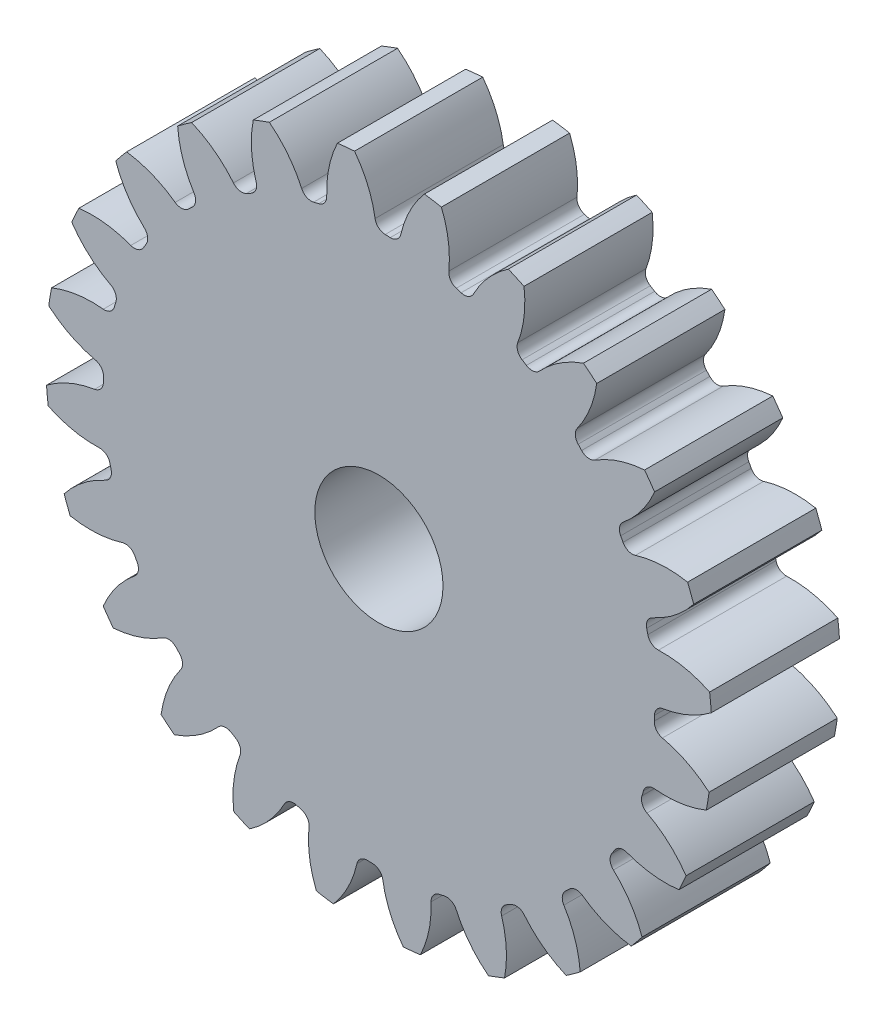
from build123d import *

# Parameters (mm, degrees)
SKETCH3_R         = 264.16
GEARBODY_DEPTH    = 101.6
TOOTHCUT_DEPTH    = 388.147996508
CIRPATTERN1_COUNT = 24
BOREDIA_R         = 50.8
BORE_DEPTH        = 12700


with BuildPart() as part:
    # Sketch3 → gearBody (new body)
    with BuildSketch(Plane.XY):
        Circle(SKETCH3_R)
    extrude(amount=GEARBODY_DEPTH)

    # Sketch2 → toothCut (cut, through all)
    with BuildSketch(Plane.XY):
        with BuildLine():
            ThreePointArc((218.254905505, -8.990540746), (218.328600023, -6.975386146), (218.383688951, -4.959637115))
            ThreePointArc((218.383688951, -4.959637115), (220.417140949, 0.286365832), (225.336119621, 3.017505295))
            ThreePointArc((225.336119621, 3.017505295), (245.802340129, 9.000332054), (264.16, 19.847300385))
            ThreePointArc((264.16, 19.847300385), (264.769454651, -8.459126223), (262.354361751, -36.668921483))
            ThreePointArc((262.354361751, -36.668921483), (244.726533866, -24.672251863), (224.683953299, -17.395208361))
            ThreePointArc((224.683953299, -17.395208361), (219.949342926, -14.355646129), (218.254905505, -8.990540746))
        make_face()
    toothcut = extrude(amount=TOOTHCUT_DEPTH, mode=Mode.SUBTRACT)

    # CirPattern1: toothCut ×24 about axis
    cirpattern1_axis = Axis((0, 0, 0), (0, 0, 1))
    for i in range(1, CIRPATTERN1_COUNT):
        add(toothcut.rotate(cirpattern1_axis, i * 360 / CIRPATTERN1_COUNT), mode=Mode.SUBTRACT)

    # boreDia → bore (cut, symmetric)
    with BuildSketch(Plane.XY):
        Circle(BOREDIA_R)
    extrude(amount=BORE_DEPTH, both=True, mode=Mode.SUBTRACT)


solid = part.part
